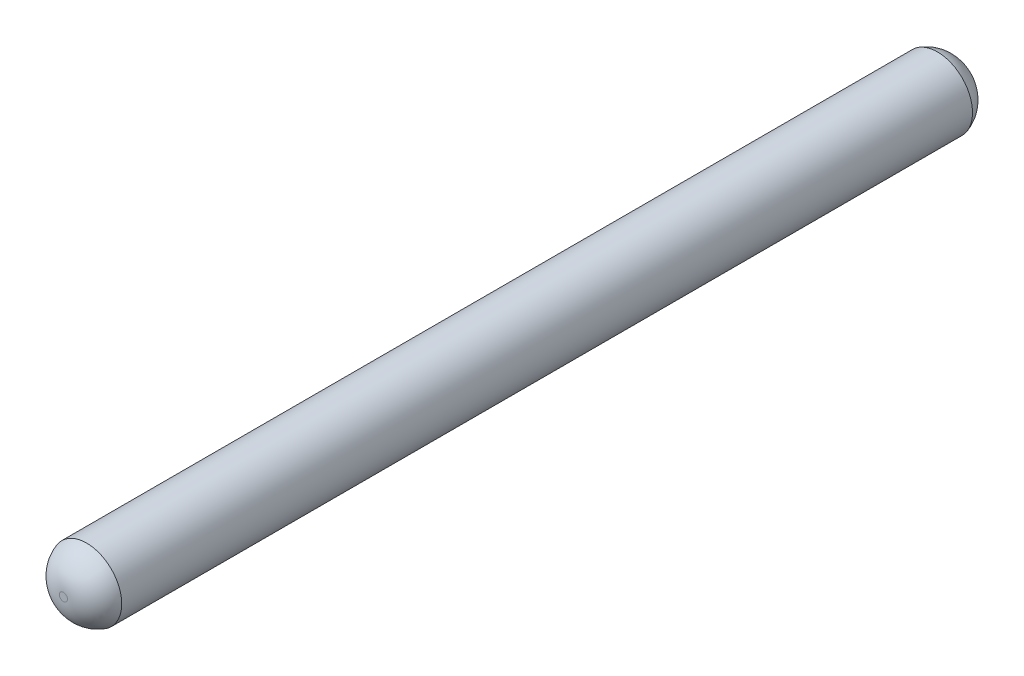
ISO-10303-21;
HEADER;
FILE_DESCRIPTION(('STEP AP214'),'2;1');
FILE_NAME('part.step','',(''),(''),'','','');
FILE_SCHEMA(('AUTOMOTIVE_DESIGN { 1 0 10303 214 1 1 1 1 }'));
ENDSEC;
DATA;
#1=APPLICATION_CONTEXT('core data for automotive mechanical design processes');
#2=APPLICATION_PROTOCOL_DEFINITION('international standard','automotive_design',2000,#1);
#3=PRODUCT_CONTEXT('',#1,'mechanical');
#4=PRODUCT('Part','Part','',(#3));
#5=PRODUCT_RELATED_PRODUCT_CATEGORY('part','',(#4));
#6=PRODUCT_DEFINITION_FORMATION('','',#4);
#7=PRODUCT_DEFINITION_CONTEXT('part definition',#1,'design');
#8=PRODUCT_DEFINITION('design','',#6,#7);
#9=PRODUCT_DEFINITION_SHAPE('','',#8);
#10=(LENGTH_UNIT() NAMED_UNIT(*) SI_UNIT(.MILLI.,.METRE.));
#11=(NAMED_UNIT(*) PLANE_ANGLE_UNIT() SI_UNIT($,.RADIAN.));
#12=(NAMED_UNIT(*) SI_UNIT($,.STERADIAN.) SOLID_ANGLE_UNIT());
#13=UNCERTAINTY_MEASURE_WITH_UNIT(LENGTH_MEASURE(1.E-05),#10,'distance_accuracy_value','');
#14=(GEOMETRIC_REPRESENTATION_CONTEXT(3) GLOBAL_UNCERTAINTY_ASSIGNED_CONTEXT((#13)) GLOBAL_UNIT_ASSIGNED_CONTEXT((#10,
#11,#12)) REPRESENTATION_CONTEXT('',''));
#15=CARTESIAN_POINT('',(0.,0.,0.));
#16=DIRECTION('',(0.,0.,1.));
#17=DIRECTION('',(1.,0.,0.));
#18=AXIS2_PLACEMENT_3D('',#15,#16,#17);
#19=CARTESIAN_POINT('',(0.,0.,-2.00000000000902));
#20=DIRECTION('',(0.,0.,1.));
#21=DIRECTION('',(0.853980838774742,0.520304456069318,0.));
#22=AXIS2_PLACEMENT_3D('',#19,#20,#21);
#23=DEGENERATE_TOROIDAL_SURFACE('',#22,0.750000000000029,6.,.T.);
#24=CARTESIAN_POINT('',(0.,0.,-3.71391365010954));
#25=DIRECTION('',(0.,0.,1.));
#26=DIRECTION('',(0.853980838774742,0.520304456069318,0.));
#27=AXIS2_PLACEMENT_3D('',#24,#25,#26);
#28=CIRCLE('',#27,6.5);
#29=CARTESIAN_POINT('',(5.55087545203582,3.38197896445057,-3.71391365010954));
#30=VERTEX_POINT('',#29);
#31=EDGE_CURVE('E8',#30,#30,#28,.T.);
#32=ORIENTED_EDGE('',*,*,#31,.F.);
#33=EDGE_LOOP('',(#32));
#34=FACE_BOUND('',#33,.T.);
#35=CARTESIAN_POINT('',(0.,0.,-8.00000000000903));
#36=DIRECTION('',(0.,0.,1.));
#37=DIRECTION('',(0.853980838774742,0.520304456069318,0.));
#38=AXIS2_PLACEMENT_3D('',#35,#36,#37);
#39=CIRCLE('',#38,0.750000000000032);
#40=CARTESIAN_POINT('',(0.640485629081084,0.390228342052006,-8.00000000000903));
#41=VERTEX_POINT('',#40);
#42=EDGE_CURVE('E20',#41,#41,#39,.T.);
#43=ORIENTED_EDGE('',*,*,#42,.T.);
#44=EDGE_LOOP('',(#43));
#45=FACE_BOUND('',#44,.T.);
#46=ADVANCED_FACE('F12',(#34,#45),#23,.T.);
#47=CARTESIAN_POINT('',(0.,0.,1.71354762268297));
#48=DIRECTION('',(0.,0.,1.));
#49=DIRECTION('',(0.853980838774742,0.520304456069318,0.));
#50=AXIS2_PLACEMENT_3D('',#47,#48,#49);
#51=CYLINDRICAL_SURFACE('',#50,6.5);
#52=ORIENTED_EDGE('',*,*,#31,.T.);
#53=EDGE_LOOP('',(#52));
#54=FACE_BOUND('',#53,.T.);
#55=CARTESIAN_POINT('',(0.,0.,153.713913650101));
#56=DIRECTION('',(0.,0.,-1.));
#57=DIRECTION('',(-0.988148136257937,0.153503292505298,0.));
#58=AXIS2_PLACEMENT_3D('',#55,#56,#57);
#59=CIRCLE('',#58,6.5);
#60=CARTESIAN_POINT('',(-6.42296288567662,0.997771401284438,153.713913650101));
#61=VERTEX_POINT('',#60);
#62=EDGE_CURVE('E16',#61,#61,#59,.T.);
#63=ORIENTED_EDGE('',*,*,#62,.T.);
#64=EDGE_LOOP('',(#63));
#65=FACE_BOUND('',#64,.T.);
#66=ADVANCED_FACE('F33',(#54,#65),#51,.T.);
#67=CARTESIAN_POINT('',(0.,0.,-8.00000000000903));
#68=DIRECTION('',(0.,0.,1.));
#69=DIRECTION('',(0.853980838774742,0.520304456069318,0.));
#70=AXIS2_PLACEMENT_3D('',#67,#68,#69);
#71=PLANE('',#70);
#72=ORIENTED_EDGE('',*,*,#42,.F.);
#73=EDGE_LOOP('',(#72));
#74=FACE_BOUND('',#73,.T.);
#75=ADVANCED_FACE('F41',(#74),#71,.F.);
#76=CARTESIAN_POINT('',(0.,0.,158.));
#77=DIRECTION('',(0.,0.,-1.));
#78=DIRECTION('',(-0.988148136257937,0.153503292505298,0.));
#79=AXIS2_PLACEMENT_3D('',#76,#77,#78);
#80=PLANE('',#79);
#81=CARTESIAN_POINT('',(0.,0.,158.));
#82=DIRECTION('',(0.,0.,-1.));
#83=DIRECTION('',(-0.988148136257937,0.153503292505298,0.));
#84=AXIS2_PLACEMENT_3D('',#81,#82,#83);
#85=CIRCLE('',#84,0.750000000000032);
#86=CARTESIAN_POINT('',(-0.741111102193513,0.115127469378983,158.));
#87=VERTEX_POINT('',#86);
#88=EDGE_CURVE('E26',#87,#87,#85,.T.);
#89=ORIENTED_EDGE('',*,*,#88,.F.);
#90=EDGE_LOOP('',(#89));
#91=FACE_BOUND('',#90,.T.);
#92=ADVANCED_FACE('F36',(#91),#80,.F.);
#93=CARTESIAN_POINT('',(0.,0.,152.));
#94=DIRECTION('',(0.,0.,-1.));
#95=DIRECTION('',(-0.988148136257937,0.153503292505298,0.));
#96=AXIS2_PLACEMENT_3D('',#93,#94,#95);
#97=DEGENERATE_TOROIDAL_SURFACE('',#96,0.750000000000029,6.,.T.);
#98=ORIENTED_EDGE('',*,*,#62,.F.);
#99=EDGE_LOOP('',(#98));
#100=FACE_BOUND('',#99,.T.);
#101=ORIENTED_EDGE('',*,*,#88,.T.);
#102=EDGE_LOOP('',(#101));
#103=FACE_BOUND('',#102,.T.);
#104=ADVANCED_FACE('F14',(#100,#103),#97,.T.);
#105=CLOSED_SHELL('',(#46,#66,#75,#92,#104));
#106=MANIFOLD_SOLID_BREP('B1',#105);
#107=ADVANCED_BREP_SHAPE_REPRESENTATION('',(#18,#106),#14);
#108=SHAPE_DEFINITION_REPRESENTATION(#9,#107);
ENDSEC;
END-ISO-10303-21;
